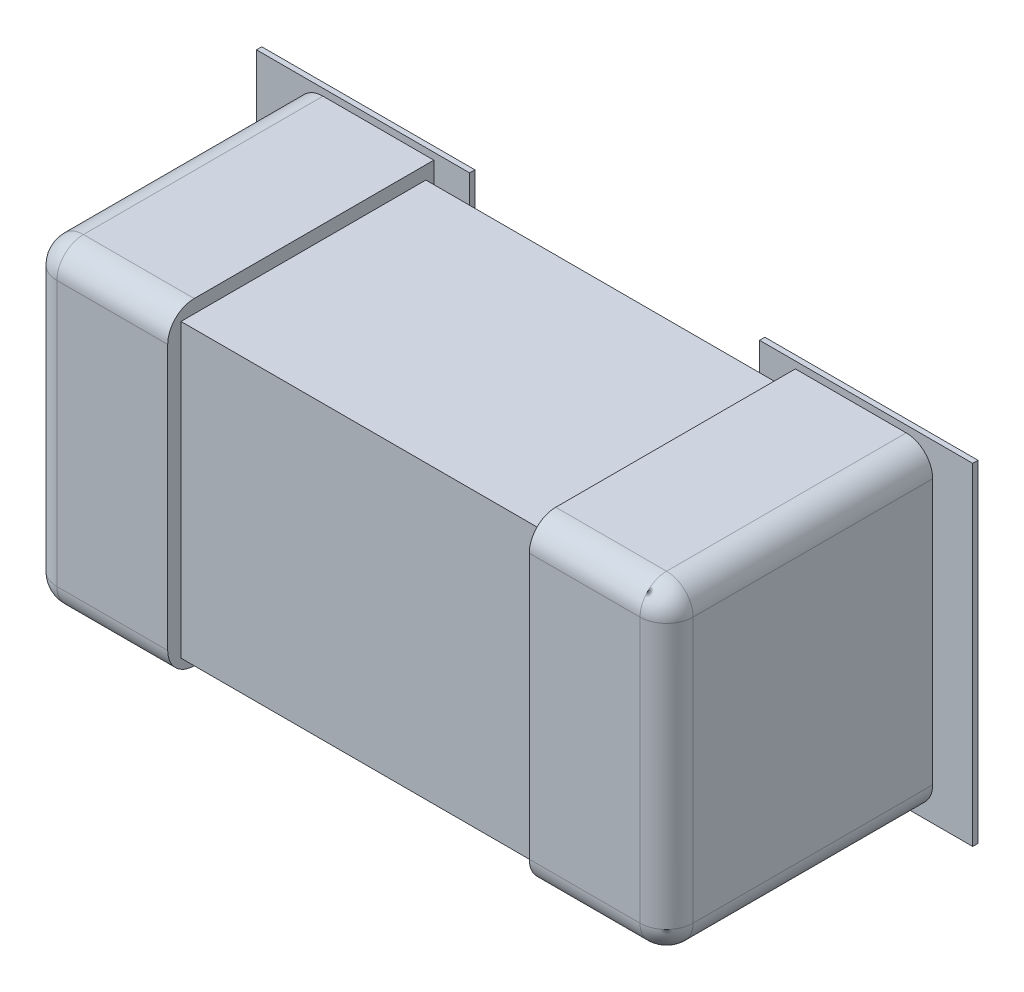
ISO-10303-21;
HEADER;
FILE_DESCRIPTION(('STEP AP214'),'2;1');
FILE_NAME('part.step','',(''),(''),'','','');
FILE_SCHEMA(('AUTOMOTIVE_DESIGN { 1 0 10303 214 1 1 1 1 }'));
ENDSEC;
DATA;
#1=APPLICATION_CONTEXT('core data for automotive mechanical design processes');
#2=APPLICATION_PROTOCOL_DEFINITION('international standard','automotive_design',2000,#1);
#3=PRODUCT_CONTEXT('',#1,'mechanical');
#4=PRODUCT('Part','Part','',(#3));
#5=PRODUCT_RELATED_PRODUCT_CATEGORY('part','',(#4));
#6=PRODUCT_DEFINITION_FORMATION('','',#4);
#7=PRODUCT_DEFINITION_CONTEXT('part definition',#1,'design');
#8=PRODUCT_DEFINITION('design','',#6,#7);
#9=PRODUCT_DEFINITION_SHAPE('','',#8);
#10=(LENGTH_UNIT() NAMED_UNIT(*) SI_UNIT(.MILLI.,.METRE.));
#11=(NAMED_UNIT(*) PLANE_ANGLE_UNIT() SI_UNIT($,.RADIAN.));
#12=(NAMED_UNIT(*) SI_UNIT($,.STERADIAN.) SOLID_ANGLE_UNIT());
#13=UNCERTAINTY_MEASURE_WITH_UNIT(LENGTH_MEASURE(1.E-05),#10,'distance_accuracy_value','');
#14=(GEOMETRIC_REPRESENTATION_CONTEXT(3) GLOBAL_UNCERTAINTY_ASSIGNED_CONTEXT((#13)) GLOBAL_UNIT_ASSIGNED_CONTEXT((#10,
#11,#12)) REPRESENTATION_CONTEXT('',''));
#15=CARTESIAN_POINT('',(0.,0.,0.));
#16=DIRECTION('',(0.,0.,1.));
#17=DIRECTION('',(1.,0.,0.));
#18=AXIS2_PLACEMENT_3D('',#15,#16,#17);
#19=CARTESIAN_POINT('',(0.,0.,0.0762));
#20=DIRECTION('',(0.,0.,1.));
#21=DIRECTION('',(1.,0.,0.));
#22=AXIS2_PLACEMENT_3D('',#19,#20,#21);
#23=PLANE('',#22);
#24=DIRECTION('',(1.,0.,0.));
#25=VECTOR('',#24,1.);
#26=CARTESIAN_POINT('',(0.138938,-0.159004,0.0762));
#27=LINE('',#26,#25);
#28=CARTESIAN_POINT('',(0.138938,-0.159004,0.0762));
#29=VERTEX_POINT('',#28);
#30=CARTESIAN_POINT('',(0.343154,-0.159004,0.0762));
#31=VERTEX_POINT('',#30);
#32=EDGE_CURVE('E330',#29,#31,#27,.T.);
#33=ORIENTED_EDGE('',*,*,#32,.F.);
#34=DIRECTION('',(0.,1.,0.));
#35=VECTOR('',#34,1.);
#36=CARTESIAN_POINT('',(0.138938,0.159004,0.0762));
#37=LINE('',#36,#35);
#38=CARTESIAN_POINT('',(0.138938,0.159004,0.0762));
#39=VERTEX_POINT('',#38);
#40=EDGE_CURVE('E335',#39,#29,#37,.F.);
#41=ORIENTED_EDGE('',*,*,#40,.F.);
#42=DIRECTION('',(1.,0.,0.));
#43=VECTOR('',#42,1.);
#44=CARTESIAN_POINT('',(0.343154,0.159004,0.0762));
#45=LINE('',#44,#43);
#46=CARTESIAN_POINT('',(0.343154,0.159004,0.0762));
#47=VERTEX_POINT('',#46);
#48=EDGE_CURVE('E319',#47,#39,#45,.F.);
#49=ORIENTED_EDGE('',*,*,#48,.F.);
#50=DIRECTION('',(0.,1.,0.));
#51=VECTOR('',#50,1.);
#52=CARTESIAN_POINT('',(0.343154,-0.159004,0.0762));
#53=LINE('',#52,#51);
#54=EDGE_CURVE('E95',#31,#47,#53,.T.);
#55=ORIENTED_EDGE('',*,*,#54,.F.);
#56=EDGE_LOOP('',(#33,#41,#49,#55));
#57=FACE_BOUND('',#56,.T.);
#58=ADVANCED_FACE('F16',(#57),#23,.F.);
#59=CARTESIAN_POINT('',(0.,0.,0.0762));
#60=DIRECTION('',(0.,0.,1.));
#61=DIRECTION('',(1.,0.,0.));
#62=AXIS2_PLACEMENT_3D('',#59,#60,#61);
#63=PLANE('',#62);
#64=DIRECTION('',(1.,0.,0.));
#65=VECTOR('',#64,1.);
#66=CARTESIAN_POINT('',(-0.138938,0.159004,0.0762));
#67=LINE('',#66,#65);
#68=CARTESIAN_POINT('',(-0.138938,0.159004,0.0762));
#69=VERTEX_POINT('',#68);
#70=CARTESIAN_POINT('',(-0.343154,0.159004,0.0762));
#71=VERTEX_POINT('',#70);
#72=EDGE_CURVE('E278',#69,#71,#67,.F.);
#73=ORIENTED_EDGE('',*,*,#72,.F.);
#74=DIRECTION('',(0.,1.,0.));
#75=VECTOR('',#74,1.);
#76=CARTESIAN_POINT('',(-0.138938,-0.159004,0.0762));
#77=LINE('',#76,#75);
#78=CARTESIAN_POINT('',(-0.138938,-0.159004,0.0762));
#79=VERTEX_POINT('',#78);
#80=EDGE_CURVE('E284',#79,#69,#77,.T.);
#81=ORIENTED_EDGE('',*,*,#80,.F.);
#82=DIRECTION('',(1.,0.,0.));
#83=VECTOR('',#82,1.);
#84=CARTESIAN_POINT('',(-0.343154,-0.159004,0.0762));
#85=LINE('',#84,#83);
#86=CARTESIAN_POINT('',(-0.343154,-0.159004,0.0762));
#87=VERTEX_POINT('',#86);
#88=EDGE_CURVE('E263',#87,#79,#85,.T.);
#89=ORIENTED_EDGE('',*,*,#88,.F.);
#90=DIRECTION('',(0.,1.,0.));
#91=VECTOR('',#90,1.);
#92=CARTESIAN_POINT('',(-0.343154,0.159004,0.0762));
#93=LINE('',#92,#91);
#94=EDGE_CURVE('E272',#71,#87,#93,.F.);
#95=ORIENTED_EDGE('',*,*,#94,.F.);
#96=EDGE_LOOP('',(#73,#81,#89,#95));
#97=FACE_BOUND('',#96,.T.);
#98=ADVANCED_FACE('F663',(#97),#63,.F.);
#99=CARTESIAN_POINT('',(0.138938,0.159004,0.0762));
#100=DIRECTION('',(-1.,0.,0.));
#101=DIRECTION('',(0.,0.,1.));
#102=AXIS2_PLACEMENT_3D('',#99,#100,#101);
#103=PLANE('',#102);
#104=DIRECTION('',(0.,0.,1.));
#105=VECTOR('',#104,1.);
#106=CARTESIAN_POINT('',(0.138938,0.159004,0.0762));
#107=LINE('',#106,#105);
#108=CARTESIAN_POINT('',(0.138938,0.159004,0.08128));
#109=VERTEX_POINT('',#108);
#110=EDGE_CURVE('E324',#39,#109,#107,.T.);
#111=ORIENTED_EDGE('',*,*,#110,.F.);
#112=ORIENTED_EDGE('',*,*,#40,.T.);
#113=DIRECTION('',(0.,0.,-1.));
#114=VECTOR('',#113,1.);
#115=CARTESIAN_POINT('',(0.138938,-0.159004,0.0762));
#116=LINE('',#115,#114);
#117=CARTESIAN_POINT('',(0.138938,-0.159004,0.08128));
#118=VERTEX_POINT('',#117);
#119=EDGE_CURVE('E332',#118,#29,#116,.T.);
#120=ORIENTED_EDGE('',*,*,#119,.F.);
#121=DIRECTION('',(0.,1.,0.));
#122=VECTOR('',#121,1.);
#123=CARTESIAN_POINT('',(0.138938,0.,0.08128));
#124=LINE('',#123,#122);
#125=EDGE_CURVE('E216',#109,#118,#124,.F.);
#126=ORIENTED_EDGE('',*,*,#125,.F.);
#127=EDGE_LOOP('',(#111,#112,#120,#126));
#128=FACE_BOUND('',#127,.T.);
#129=ADVANCED_FACE('F669',(#128),#103,.T.);
#130=CARTESIAN_POINT('',(0.138938,-0.159004,0.0762));
#131=DIRECTION('',(0.,-1.,0.));
#132=DIRECTION('',(0.,0.,-1.));
#133=AXIS2_PLACEMENT_3D('',#130,#131,#132);
#134=PLANE('',#133);
#135=ORIENTED_EDGE('',*,*,#119,.T.);
#136=ORIENTED_EDGE('',*,*,#32,.T.);
#137=DIRECTION('',(0.,0.,-1.));
#138=VECTOR('',#137,1.);
#139=CARTESIAN_POINT('',(0.343154,-0.159004,0.0762));
#140=LINE('',#139,#138);
#141=CARTESIAN_POINT('',(0.343154,-0.159004,0.08128));
#142=VERTEX_POINT('',#141);
#143=EDGE_CURVE('E328',#142,#31,#140,.T.);
#144=ORIENTED_EDGE('',*,*,#143,.F.);
#145=DIRECTION('',(1.,0.,0.));
#146=VECTOR('',#145,1.);
#147=CARTESIAN_POINT('',(0.,-0.159004,0.08128));
#148=LINE('',#147,#146);
#149=EDGE_CURVE('E213',#118,#142,#148,.T.);
#150=ORIENTED_EDGE('',*,*,#149,.F.);
#151=EDGE_LOOP('',(#135,#136,#144,#150));
#152=FACE_BOUND('',#151,.T.);
#153=ADVANCED_FACE('F714',(#152),#134,.T.);
#154=CARTESIAN_POINT('',(0.343154,-0.159004,0.0762));
#155=DIRECTION('',(1.,0.,0.));
#156=DIRECTION('',(0.,0.,-1.));
#157=AXIS2_PLACEMENT_3D('',#154,#155,#156);
#158=PLANE('',#157);
#159=ORIENTED_EDGE('',*,*,#143,.T.);
#160=ORIENTED_EDGE('',*,*,#54,.T.);
#161=DIRECTION('',(0.,0.,1.));
#162=VECTOR('',#161,1.);
#163=CARTESIAN_POINT('',(0.343154,0.159004,0.0762));
#164=LINE('',#163,#162);
#165=CARTESIAN_POINT('',(0.343154,0.159004,0.08128));
#166=VERTEX_POINT('',#165);
#167=EDGE_CURVE('E322',#166,#47,#164,.F.);
#168=ORIENTED_EDGE('',*,*,#167,.F.);
#169=DIRECTION('',(0.,1.,0.));
#170=VECTOR('',#169,1.);
#171=CARTESIAN_POINT('',(0.343154,0.,0.08128));
#172=LINE('',#171,#170);
#173=EDGE_CURVE('E210',#142,#166,#172,.T.);
#174=ORIENTED_EDGE('',*,*,#173,.F.);
#175=EDGE_LOOP('',(#159,#160,#168,#174));
#176=FACE_BOUND('',#175,.T.);
#177=ADVANCED_FACE('F721',(#176),#158,.T.);
#178=CARTESIAN_POINT('',(0.343154,0.159004,0.0762));
#179=DIRECTION('',(0.,1.,0.));
#180=DIRECTION('',(0.,0.,1.));
#181=AXIS2_PLACEMENT_3D('',#178,#179,#180);
#182=PLANE('',#181);
#183=ORIENTED_EDGE('',*,*,#167,.T.);
#184=ORIENTED_EDGE('',*,*,#48,.T.);
#185=ORIENTED_EDGE('',*,*,#110,.T.);
#186=DIRECTION('',(1.,0.,0.));
#187=VECTOR('',#186,1.);
#188=CARTESIAN_POINT('',(0.,0.159004,0.08128));
#189=LINE('',#188,#187);
#190=EDGE_CURVE('E207',#166,#109,#189,.F.);
#191=ORIENTED_EDGE('',*,*,#190,.F.);
#192=EDGE_LOOP('',(#183,#184,#185,#191));
#193=FACE_BOUND('',#192,.T.);
#194=ADVANCED_FACE('F729',(#193),#182,.T.);
#195=CARTESIAN_POINT('',(0.3048,-0.1524,0.0762));
#196=DIRECTION('',(1.,0.,0.));
#197=DIRECTION('',(0.,0.,-1.));
#198=AXIS2_PLACEMENT_3D('',#195,#196,#197);
#199=PLANE('',#198);
#200=DIRECTION('',(0.,0.,-1.));
#201=VECTOR('',#200,1.);
#202=CARTESIAN_POINT('',(0.3048,-0.127,0.6753571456));
#203=LINE('',#202,#201);
#204=CARTESIAN_POINT('',(0.3048,-0.127,0.08128));
#205=VERTEX_POINT('',#204);
#206=CARTESIAN_POINT('',(0.3048,-0.127,0.310896));
#207=VERTEX_POINT('',#206);
#208=EDGE_CURVE('E315',#205,#207,#203,.F.);
#209=ORIENTED_EDGE('',*,*,#208,.F.);
#210=DIRECTION('',(0.,1.,0.));
#211=VECTOR('',#210,1.);
#212=CARTESIAN_POINT('',(0.3048,0.,0.08128));
#213=LINE('',#212,#211);
#214=CARTESIAN_POINT('',(0.3048,0.127,0.08128));
#215=VERTEX_POINT('',#214);
#216=EDGE_CURVE('E205',#215,#205,#213,.F.);
#217=ORIENTED_EDGE('',*,*,#216,.F.);
#218=DIRECTION('',(0.,0.,-1.));
#219=VECTOR('',#218,1.);
#220=CARTESIAN_POINT('',(0.3048,0.127,0.6753571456));
#221=LINE('',#220,#219);
#222=CARTESIAN_POINT('',(0.3048,0.127,0.310896));
#223=VERTEX_POINT('',#222);
#224=EDGE_CURVE('E86',#223,#215,#221,.T.);
#225=ORIENTED_EDGE('',*,*,#224,.F.);
#226=DIRECTION('',(0.,1.,0.));
#227=VECTOR('',#226,1.);
#228=CARTESIAN_POINT('',(0.3048,-0.5735592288,0.310896));
#229=LINE('',#228,#227);
#230=EDGE_CURVE('E341',#207,#223,#229,.T.);
#231=ORIENTED_EDGE('',*,*,#230,.F.);
#232=EDGE_LOOP('',(#209,#217,#225,#231));
#233=FACE_BOUND('',#232,.T.);
#234=ADVANCED_FACE('F736',(#233),#199,.T.);
#235=CARTESIAN_POINT('',(0.2794,0.127,0.6753571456));
#236=DIRECTION('',(0.,0.,-1.));
#237=DIRECTION('',(-1.,0.,0.));
#238=AXIS2_PLACEMENT_3D('',#235,#236,#237);
#239=CYLINDRICAL_SURFACE('',#238,0.0254);
#240=ORIENTED_EDGE('',*,*,#224,.T.);
#241=CARTESIAN_POINT('',(0.2794,0.127,0.08128));
#242=DIRECTION('',(0.,0.,-1.));
#243=DIRECTION('',(-1.,0.,0.));
#244=AXIS2_PLACEMENT_3D('',#241,#242,#243);
#245=CIRCLE('',#244,0.0254);
#246=CARTESIAN_POINT('',(0.2794,0.1524,0.08128));
#247=VERTEX_POINT('',#246);
#248=EDGE_CURVE('E185',#247,#215,#245,.T.);
#249=ORIENTED_EDGE('',*,*,#248,.F.);
#250=DIRECTION('',(0.,0.,1.));
#251=VECTOR('',#250,1.);
#252=CARTESIAN_POINT('',(0.2794,0.1524,0.0762));
#253=LINE('',#252,#251);
#254=CARTESIAN_POINT('',(0.2794,0.1524,0.310896));
#255=VERTEX_POINT('',#254);
#256=EDGE_CURVE('E162',#255,#247,#253,.F.);
#257=ORIENTED_EDGE('',*,*,#256,.F.);
#258=CARTESIAN_POINT('',(0.2794,0.127,0.310896));
#259=DIRECTION('',(0.,0.,-1.));
#260=DIRECTION('',(-1.,0.,0.));
#261=AXIS2_PLACEMENT_3D('',#258,#259,#260);
#262=CIRCLE('',#261,0.0254);
#263=EDGE_CURVE('E19',#223,#255,#262,.F.);
#264=ORIENTED_EDGE('',*,*,#263,.F.);
#265=EDGE_LOOP('',(#240,#249,#257,#264));
#266=FACE_BOUND('',#265,.T.);
#267=ADVANCED_FACE('F183',(#266),#239,.T.);
#268=CARTESIAN_POINT('',(0.2794,0.127,0.310896));
#269=DIRECTION('',(0.,0.707106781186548,0.707106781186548));
#270=DIRECTION('',(1.,0.,0.));
#271=AXIS2_PLACEMENT_3D('',#268,#269,#270);
#272=SPHERICAL_SURFACE('',#271,0.0254);
#273=CARTESIAN_POINT('',(0.2794,0.127,0.310896));
#274=DIRECTION('',(-1.,0.,0.));
#275=DIRECTION('',(0.,0.,1.));
#276=AXIS2_PLACEMENT_3D('',#273,#274,#275);
#277=CIRCLE('',#276,0.0254);
#278=CARTESIAN_POINT('',(0.2794,0.127,0.336296));
#279=VERTEX_POINT('',#278);
#280=CARTESIAN_POINT('',(0.2794,0.144960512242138,0.328856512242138));
#281=VERTEX_POINT('',#280);
#282=EDGE_CURVE('E181',#279,#281,#277,.T.);
#283=ORIENTED_EDGE('',*,*,#282,.F.);
#284=CARTESIAN_POINT('',(0.2794,0.127,0.310896));
#285=DIRECTION('',(0.,1.,0.));
#286=DIRECTION('',(0.,0.,1.));
#287=AXIS2_PLACEMENT_3D('',#284,#285,#286);
#288=CIRCLE('',#287,0.0254);
#289=EDGE_CURVE('E172',#223,#279,#288,.F.);
#290=ORIENTED_EDGE('',*,*,#289,.F.);
#291=ORIENTED_EDGE('',*,*,#263,.T.);
#292=CARTESIAN_POINT('',(0.2794,0.127,0.310896));
#293=DIRECTION('',(-1.,0.,0.));
#294=DIRECTION('',(0.,0.,1.));
#295=AXIS2_PLACEMENT_3D('',#292,#293,#294);
#296=CIRCLE('',#295,0.0254);
#297=EDGE_CURVE('E171',#281,#255,#296,.T.);
#298=ORIENTED_EDGE('',*,*,#297,.F.);
#299=EDGE_LOOP('',(#283,#290,#291,#298));
#300=FACE_BOUND('',#299,.T.);
#301=ADVANCED_FACE('F170',(#300),#272,.T.);
#302=CARTESIAN_POINT('',(0.2794,-0.5735592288,0.310896));
#303=DIRECTION('',(0.,1.,0.));
#304=DIRECTION('',(0.,0.,1.));
#305=AXIS2_PLACEMENT_3D('',#302,#303,#304);
#306=CYLINDRICAL_SURFACE('',#305,0.0254);
#307=CARTESIAN_POINT('',(0.2794,-0.127,0.310896));
#308=DIRECTION('',(0.,1.,0.));
#309=DIRECTION('',(0.,0.,1.));
#310=AXIS2_PLACEMENT_3D('',#307,#308,#309);
#311=CIRCLE('',#310,0.0254);
#312=CARTESIAN_POINT('',(0.297360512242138,-0.127,0.328856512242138));
#313=VERTEX_POINT('',#312);
#314=EDGE_CURVE('E343',#207,#313,#311,.F.);
#315=ORIENTED_EDGE('',*,*,#314,.F.);
#316=ORIENTED_EDGE('',*,*,#230,.T.);
#317=ORIENTED_EDGE('',*,*,#289,.T.);
#318=DIRECTION('',(0.,1.,0.));
#319=VECTOR('',#318,1.);
#320=CARTESIAN_POINT('',(0.2794,0.,0.336296));
#321=LINE('',#320,#319);
#322=CARTESIAN_POINT('',(0.2794,-0.127,0.336296));
#323=VERTEX_POINT('',#322);
#324=EDGE_CURVE('E194',#323,#279,#321,.T.);
#325=ORIENTED_EDGE('',*,*,#324,.F.);
#326=CARTESIAN_POINT('',(0.2794,-0.127,0.310896));
#327=DIRECTION('',(0.,-1.,0.));
#328=DIRECTION('',(0.707106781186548,0.,0.707106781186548));
#329=AXIS2_PLACEMENT_3D('',#326,#327,#328);
#330=CIRCLE('',#329,0.0254);
#331=EDGE_CURVE('E295',#313,#323,#330,.T.);
#332=ORIENTED_EDGE('',*,*,#331,.F.);
#333=EDGE_LOOP('',(#315,#316,#317,#325,#332));
#334=FACE_BOUND('',#333,.T.);
#335=ADVANCED_FACE('F303',(#334),#306,.T.);
#336=CARTESIAN_POINT('',(0.2794,-0.127,0.310896));
#337=DIRECTION('',(0.707106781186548,0.,0.707106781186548));
#338=DIRECTION('',(0.,-1.,0.));
#339=AXIS2_PLACEMENT_3D('',#336,#337,#338);
#340=SPHERICAL_SURFACE('',#339,0.0254);
#341=ORIENTED_EDGE('',*,*,#331,.T.);
#342=CARTESIAN_POINT('',(0.2794,-0.127,0.310896));
#343=DIRECTION('',(1.,0.,0.));
#344=DIRECTION('',(0.,0.,-1.));
#345=AXIS2_PLACEMENT_3D('',#342,#343,#344);
#346=CIRCLE('',#345,0.0254);
#347=CARTESIAN_POINT('',(0.2794,-0.1524,0.310896));
#348=VERTEX_POINT('',#347);
#349=EDGE_CURVE('E373',#348,#323,#346,.F.);
#350=ORIENTED_EDGE('',*,*,#349,.F.);
#351=CARTESIAN_POINT('',(0.2794,-0.127,0.310896));
#352=DIRECTION('',(0.,0.,-1.));
#353=DIRECTION('',(-1.,0.,0.));
#354=AXIS2_PLACEMENT_3D('',#351,#352,#353);
#355=CIRCLE('',#354,0.0254);
#356=EDGE_CURVE('E287',#207,#348,#355,.T.);
#357=ORIENTED_EDGE('',*,*,#356,.F.);
#358=ORIENTED_EDGE('',*,*,#314,.T.);
#359=EDGE_LOOP('',(#341,#350,#357,#358));
#360=FACE_BOUND('',#359,.T.);
#361=ADVANCED_FACE('F298',(#360),#340,.T.);
#362=CARTESIAN_POINT('',(0.2794,-0.127,0.6753571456));
#363=DIRECTION('',(0.,0.,-1.));
#364=DIRECTION('',(-1.,0.,0.));
#365=AXIS2_PLACEMENT_3D('',#362,#363,#364);
#366=CYLINDRICAL_SURFACE('',#365,0.0254);
#367=DIRECTION('',(0.,0.,-1.));
#368=VECTOR('',#367,1.);
#369=CARTESIAN_POINT('',(0.2794,-0.1524,0.0762));
#370=LINE('',#369,#368);
#371=CARTESIAN_POINT('',(0.2794,-0.1524,0.08128));
#372=VERTEX_POINT('',#371);
#373=EDGE_CURVE('E288',#372,#348,#370,.F.);
#374=ORIENTED_EDGE('',*,*,#373,.F.);
#375=CARTESIAN_POINT('',(0.2794,-0.127,0.08128));
#376=DIRECTION('',(0.,0.,-1.));
#377=DIRECTION('',(-1.,0.,0.));
#378=AXIS2_PLACEMENT_3D('',#375,#376,#377);
#379=CIRCLE('',#378,0.0254);
#380=EDGE_CURVE('E188',#205,#372,#379,.T.);
#381=ORIENTED_EDGE('',*,*,#380,.F.);
#382=ORIENTED_EDGE('',*,*,#208,.T.);
#383=ORIENTED_EDGE('',*,*,#356,.T.);
#384=EDGE_LOOP('',(#374,#381,#382,#383));
#385=FACE_BOUND('',#384,.T.);
#386=ADVANCED_FACE('F302',(#385),#366,.T.);
#387=CARTESIAN_POINT('',(-0.138938,-0.159004,0.0762));
#388=DIRECTION('',(1.,0.,0.));
#389=DIRECTION('',(0.,0.,-1.));
#390=AXIS2_PLACEMENT_3D('',#387,#388,#389);
#391=PLANE('',#390);
#392=DIRECTION('',(0.,0.,-1.));
#393=VECTOR('',#392,1.);
#394=CARTESIAN_POINT('',(-0.138938,-0.159004,0.0762));
#395=LINE('',#394,#393);
#396=CARTESIAN_POINT('',(-0.138938,-0.159004,0.08128));
#397=VERTEX_POINT('',#396);
#398=EDGE_CURVE('E269',#79,#397,#395,.F.);
#399=ORIENTED_EDGE('',*,*,#398,.F.);
#400=ORIENTED_EDGE('',*,*,#80,.T.);
#401=DIRECTION('',(0.,0.,1.));
#402=VECTOR('',#401,1.);
#403=CARTESIAN_POINT('',(-0.138938,0.159004,0.0762));
#404=LINE('',#403,#402);
#405=CARTESIAN_POINT('',(-0.138938,0.159004,0.08128));
#406=VERTEX_POINT('',#405);
#407=EDGE_CURVE('E281',#406,#69,#404,.F.);
#408=ORIENTED_EDGE('',*,*,#407,.F.);
#409=DIRECTION('',(0.,1.,0.));
#410=VECTOR('',#409,1.);
#411=CARTESIAN_POINT('',(-0.138938,0.,0.08128));
#412=LINE('',#411,#410);
#413=EDGE_CURVE('E438',#397,#406,#412,.T.);
#414=ORIENTED_EDGE('',*,*,#413,.F.);
#415=EDGE_LOOP('',(#399,#400,#408,#414));
#416=FACE_BOUND('',#415,.T.);
#417=ADVANCED_FACE('F766',(#416),#391,.T.);
#418=CARTESIAN_POINT('',(-0.138938,0.159004,0.0762));
#419=DIRECTION('',(0.,1.,0.));
#420=DIRECTION('',(0.,0.,1.));
#421=AXIS2_PLACEMENT_3D('',#418,#419,#420);
#422=PLANE('',#421);
#423=ORIENTED_EDGE('',*,*,#407,.T.);
#424=ORIENTED_EDGE('',*,*,#72,.T.);
#425=DIRECTION('',(0.,0.,1.));
#426=VECTOR('',#425,1.);
#427=CARTESIAN_POINT('',(-0.343154,0.159004,0.0762));
#428=LINE('',#427,#426);
#429=CARTESIAN_POINT('',(-0.343154,0.159004,0.08128));
#430=VERTEX_POINT('',#429);
#431=EDGE_CURVE('E275',#430,#71,#428,.F.);
#432=ORIENTED_EDGE('',*,*,#431,.F.);
#433=DIRECTION('',(1.,0.,0.));
#434=VECTOR('',#433,1.);
#435=CARTESIAN_POINT('',(0.,0.159004,0.08128));
#436=LINE('',#435,#434);
#437=EDGE_CURVE('E435',#406,#430,#436,.F.);
#438=ORIENTED_EDGE('',*,*,#437,.F.);
#439=EDGE_LOOP('',(#423,#424,#432,#438));
#440=FACE_BOUND('',#439,.T.);
#441=ADVANCED_FACE('F772',(#440),#422,.T.);
#442=CARTESIAN_POINT('',(-0.343154,0.159004,0.0762));
#443=DIRECTION('',(-1.,0.,0.));
#444=DIRECTION('',(0.,0.,1.));
#445=AXIS2_PLACEMENT_3D('',#442,#443,#444);
#446=PLANE('',#445);
#447=ORIENTED_EDGE('',*,*,#431,.T.);
#448=ORIENTED_EDGE('',*,*,#94,.T.);
#449=DIRECTION('',(0.,0.,-1.));
#450=VECTOR('',#449,1.);
#451=CARTESIAN_POINT('',(-0.343154,-0.159004,0.0762));
#452=LINE('',#451,#450);
#453=CARTESIAN_POINT('',(-0.343154,-0.159004,0.08128));
#454=VERTEX_POINT('',#453);
#455=EDGE_CURVE('E266',#454,#87,#452,.T.);
#456=ORIENTED_EDGE('',*,*,#455,.F.);
#457=DIRECTION('',(0.,1.,0.));
#458=VECTOR('',#457,1.);
#459=CARTESIAN_POINT('',(-0.343154,0.,0.08128));
#460=LINE('',#459,#458);
#461=EDGE_CURVE('E432',#430,#454,#460,.F.);
#462=ORIENTED_EDGE('',*,*,#461,.F.);
#463=EDGE_LOOP('',(#447,#448,#456,#462));
#464=FACE_BOUND('',#463,.T.);
#465=ADVANCED_FACE('F779',(#464),#446,.T.);
#466=CARTESIAN_POINT('',(-0.343154,-0.159004,0.0762));
#467=DIRECTION('',(0.,-1.,0.));
#468=DIRECTION('',(0.,0.,-1.));
#469=AXIS2_PLACEMENT_3D('',#466,#467,#468);
#470=PLANE('',#469);
#471=ORIENTED_EDGE('',*,*,#455,.T.);
#472=ORIENTED_EDGE('',*,*,#88,.T.);
#473=ORIENTED_EDGE('',*,*,#398,.T.);
#474=DIRECTION('',(1.,0.,0.));
#475=VECTOR('',#474,1.);
#476=CARTESIAN_POINT('',(0.,-0.159004,0.08128));
#477=LINE('',#476,#475);
#478=EDGE_CURVE('E372',#454,#397,#477,.T.);
#479=ORIENTED_EDGE('',*,*,#478,.F.);
#480=EDGE_LOOP('',(#471,#472,#473,#479));
#481=FACE_BOUND('',#480,.T.);
#482=ADVANCED_FACE('F787',(#481),#470,.T.);
#483=CARTESIAN_POINT('',(-0.3048,0.1524,0.0762));
#484=DIRECTION('',(-1.,0.,0.));
#485=DIRECTION('',(0.,0.,1.));
#486=AXIS2_PLACEMENT_3D('',#483,#484,#485);
#487=PLANE('',#486);
#488=DIRECTION('',(0.,0.,-1.));
#489=VECTOR('',#488,1.);
#490=CARTESIAN_POINT('',(-0.3048,0.127,0.6753571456));
#491=LINE('',#490,#489);
#492=CARTESIAN_POINT('',(-0.3048,0.127,0.08128));
#493=VERTEX_POINT('',#492);
#494=CARTESIAN_POINT('',(-0.3048,0.127,0.310896));
#495=VERTEX_POINT('',#494);
#496=EDGE_CURVE('E226',#493,#495,#491,.F.);
#497=ORIENTED_EDGE('',*,*,#496,.F.);
#498=DIRECTION('',(0.,1.,0.));
#499=VECTOR('',#498,1.);
#500=CARTESIAN_POINT('',(-0.3048,0.,0.08128));
#501=LINE('',#500,#499);
#502=CARTESIAN_POINT('',(-0.3048,-0.127,0.08128));
#503=VERTEX_POINT('',#502);
#504=EDGE_CURVE('E368',#503,#493,#501,.T.);
#505=ORIENTED_EDGE('',*,*,#504,.F.);
#506=DIRECTION('',(0.,0.,-1.));
#507=VECTOR('',#506,1.);
#508=CARTESIAN_POINT('',(-0.3048,-0.127,0.6753571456));
#509=LINE('',#508,#507);
#510=CARTESIAN_POINT('',(-0.3048,-0.127,0.310896));
#511=VERTEX_POINT('',#510);
#512=EDGE_CURVE('E260',#511,#503,#509,.T.);
#513=ORIENTED_EDGE('',*,*,#512,.F.);
#514=DIRECTION('',(0.,-1.,0.));
#515=VECTOR('',#514,1.);
#516=CARTESIAN_POINT('',(-0.3048,0.5735592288,0.310896));
#517=LINE('',#516,#515);
#518=EDGE_CURVE('E337',#495,#511,#517,.T.);
#519=ORIENTED_EDGE('',*,*,#518,.F.);
#520=EDGE_LOOP('',(#497,#505,#513,#519));
#521=FACE_BOUND('',#520,.T.);
#522=ADVANCED_FACE('F795',(#521),#487,.T.);
#523=CARTESIAN_POINT('',(-0.2794,-0.127,0.6753571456));
#524=DIRECTION('',(0.,0.,-1.));
#525=DIRECTION('',(-1.,0.,0.));
#526=AXIS2_PLACEMENT_3D('',#523,#524,#525);
#527=CYLINDRICAL_SURFACE('',#526,0.0254);
#528=ORIENTED_EDGE('',*,*,#512,.T.);
#529=CARTESIAN_POINT('',(-0.2794,-0.127,0.08128));
#530=DIRECTION('',(0.,0.,-1.));
#531=DIRECTION('',(-1.,0.,0.));
#532=AXIS2_PLACEMENT_3D('',#529,#530,#531);
#533=CIRCLE('',#532,0.0254);
#534=CARTESIAN_POINT('',(-0.2794,-0.1524,0.08128));
#535=VERTEX_POINT('',#534);
#536=EDGE_CURVE('E369',#535,#503,#533,.T.);
#537=ORIENTED_EDGE('',*,*,#536,.F.);
#538=DIRECTION('',(0.,0.,-1.));
#539=VECTOR('',#538,1.);
#540=CARTESIAN_POINT('',(-0.2794,-0.1524,0.0762));
#541=LINE('',#540,#539);
#542=CARTESIAN_POINT('',(-0.2794,-0.1524,0.310896));
#543=VERTEX_POINT('',#542);
#544=EDGE_CURVE('E257',#543,#535,#541,.T.);
#545=ORIENTED_EDGE('',*,*,#544,.F.);
#546=CARTESIAN_POINT('',(-0.2794,-0.127,0.310896));
#547=DIRECTION('',(0.,0.,-1.));
#548=DIRECTION('',(-1.,0.,0.));
#549=AXIS2_PLACEMENT_3D('',#546,#547,#548);
#550=CIRCLE('',#549,0.0254);
#551=EDGE_CURVE('E262',#511,#543,#550,.F.);
#552=ORIENTED_EDGE('',*,*,#551,.F.);
#553=EDGE_LOOP('',(#528,#537,#545,#552));
#554=FACE_BOUND('',#553,.T.);
#555=ADVANCED_FACE('F252',(#554),#527,.T.);
#556=CARTESIAN_POINT('',(-0.2794,-0.127,0.310896));
#557=DIRECTION('',(0.,-0.707106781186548,0.707106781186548));
#558=DIRECTION('',(-1.,0.,0.));
#559=AXIS2_PLACEMENT_3D('',#556,#557,#558);
#560=SPHERICAL_SURFACE('',#559,0.0254);
#561=CARTESIAN_POINT('',(-0.2794,-0.127,0.310896));
#562=DIRECTION('',(1.,0.,0.));
#563=DIRECTION('',(0.,0.,-1.));
#564=AXIS2_PLACEMENT_3D('',#561,#562,#563);
#565=CIRCLE('',#564,0.0254);
#566=CARTESIAN_POINT('',(-0.2794,-0.127,0.336296));
#567=VERTEX_POINT('',#566);
#568=CARTESIAN_POINT('',(-0.2794,-0.144960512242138,0.328856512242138));
#569=VERTEX_POINT('',#568);
#570=EDGE_CURVE('E234',#567,#569,#565,.T.);
#571=ORIENTED_EDGE('',*,*,#570,.F.);
#572=CARTESIAN_POINT('',(-0.2794,-0.127,0.310896));
#573=DIRECTION('',(0.,-1.,0.));
#574=DIRECTION('',(0.,0.,-1.));
#575=AXIS2_PLACEMENT_3D('',#572,#573,#574);
#576=CIRCLE('',#575,0.0254);
#577=EDGE_CURVE('E340',#511,#567,#576,.F.);
#578=ORIENTED_EDGE('',*,*,#577,.F.);
#579=ORIENTED_EDGE('',*,*,#551,.T.);
#580=CARTESIAN_POINT('',(-0.2794,-0.127,0.310896));
#581=DIRECTION('',(1.,0.,0.));
#582=DIRECTION('',(0.,0.,-1.));
#583=AXIS2_PLACEMENT_3D('',#580,#581,#582);
#584=CIRCLE('',#583,0.0254);
#585=EDGE_CURVE('E363',#569,#543,#584,.T.);
#586=ORIENTED_EDGE('',*,*,#585,.F.);
#587=EDGE_LOOP('',(#571,#578,#579,#586));
#588=FACE_BOUND('',#587,.T.);
#589=ADVANCED_FACE('F247',(#588),#560,.T.);
#590=CARTESIAN_POINT('',(-0.2794,0.5735592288,0.310896));
#591=DIRECTION('',(0.,-1.,0.));
#592=DIRECTION('',(0.,0.,-1.));
#593=AXIS2_PLACEMENT_3D('',#590,#591,#592);
#594=CYLINDRICAL_SURFACE('',#593,0.0254);
#595=CARTESIAN_POINT('',(-0.2794,0.127,0.310896));
#596=DIRECTION('',(0.,-1.,0.));
#597=DIRECTION('',(0.,0.,-1.));
#598=AXIS2_PLACEMENT_3D('',#595,#596,#597);
#599=CIRCLE('',#598,0.0254);
#600=CARTESIAN_POINT('',(-0.2794,0.127,0.336296));
#601=VERTEX_POINT('',#600);
#602=EDGE_CURVE('E259',#495,#601,#599,.F.);
#603=ORIENTED_EDGE('',*,*,#602,.F.);
#604=ORIENTED_EDGE('',*,*,#518,.T.);
#605=ORIENTED_EDGE('',*,*,#577,.T.);
#606=DIRECTION('',(0.,1.,0.));
#607=VECTOR('',#606,1.);
#608=CARTESIAN_POINT('',(-0.2794,0.,0.336296));
#609=LINE('',#608,#607);
#610=EDGE_CURVE('E227',#601,#567,#609,.F.);
#611=ORIENTED_EDGE('',*,*,#610,.F.);
#612=EDGE_LOOP('',(#603,#604,#605,#611));
#613=FACE_BOUND('',#612,.T.);
#614=ADVANCED_FACE('F242',(#613),#594,.T.);
#615=CARTESIAN_POINT('',(-0.2794,0.127,0.310896));
#616=DIRECTION('',(-0.707106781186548,0.707106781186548,0.));
#617=DIRECTION('',(0.,0.,1.));
#618=AXIS2_PLACEMENT_3D('',#615,#616,#617);
#619=SPHERICAL_SURFACE('',#618,0.0254);
#620=ORIENTED_EDGE('',*,*,#602,.T.);
#621=CARTESIAN_POINT('',(-0.2794,0.127,0.310896));
#622=DIRECTION('',(-1.,0.,0.));
#623=DIRECTION('',(0.,0.,1.));
#624=AXIS2_PLACEMENT_3D('',#621,#622,#623);
#625=CIRCLE('',#624,0.0254);
#626=CARTESIAN_POINT('',(-0.2794,0.1524,0.310896));
#627=VERTEX_POINT('',#626);
#628=EDGE_CURVE('E360',#627,#601,#625,.F.);
#629=ORIENTED_EDGE('',*,*,#628,.F.);
#630=CARTESIAN_POINT('',(-0.2794,0.127,0.310896));
#631=DIRECTION('',(0.,0.,-1.));
#632=DIRECTION('',(-1.,0.,0.));
#633=AXIS2_PLACEMENT_3D('',#630,#631,#632);
#634=CIRCLE('',#633,0.0254);
#635=CARTESIAN_POINT('',(-0.297360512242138,0.144960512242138,0.310896));
#636=VERTEX_POINT('',#635);
#637=EDGE_CURVE('E219',#636,#627,#634,.T.);
#638=ORIENTED_EDGE('',*,*,#637,.F.);
#639=CARTESIAN_POINT('',(-0.2794,0.127,0.310896));
#640=DIRECTION('',(0.,0.,-1.));
#641=DIRECTION('',(-1.,0.,0.));
#642=AXIS2_PLACEMENT_3D('',#639,#640,#641);
#643=CIRCLE('',#642,0.0254);
#644=EDGE_CURVE('E34',#495,#636,#643,.T.);
#645=ORIENTED_EDGE('',*,*,#644,.F.);
#646=EDGE_LOOP('',(#620,#629,#638,#645));
#647=FACE_BOUND('',#646,.T.);
#648=ADVANCED_FACE('F237',(#647),#619,.T.);
#649=CARTESIAN_POINT('',(-0.2794,0.127,0.6753571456));
#650=DIRECTION('',(0.,0.,-1.));
#651=DIRECTION('',(-1.,0.,0.));
#652=AXIS2_PLACEMENT_3D('',#649,#650,#651);
#653=CYLINDRICAL_SURFACE('',#652,0.0254);
#654=DIRECTION('',(0.,0.,1.));
#655=VECTOR('',#654,1.);
#656=CARTESIAN_POINT('',(-0.2794,0.1524,0.0762));
#657=LINE('',#656,#655);
#658=CARTESIAN_POINT('',(-0.2794,0.1524,0.08128));
#659=VERTEX_POINT('',#658);
#660=EDGE_CURVE('E220',#659,#627,#657,.T.);
#661=ORIENTED_EDGE('',*,*,#660,.F.);
#662=CARTESIAN_POINT('',(-0.2794,0.127,0.08128));
#663=DIRECTION('',(0.,0.,-1.));
#664=DIRECTION('',(-1.,0.,0.));
#665=AXIS2_PLACEMENT_3D('',#662,#663,#664);
#666=CIRCLE('',#665,0.0254);
#667=EDGE_CURVE('E366',#493,#659,#666,.T.);
#668=ORIENTED_EDGE('',*,*,#667,.F.);
#669=ORIENTED_EDGE('',*,*,#496,.T.);
#670=ORIENTED_EDGE('',*,*,#644,.T.);
#671=ORIENTED_EDGE('',*,*,#637,.T.);
#672=EDGE_LOOP('',(#661,#668,#669,#670,#671));
#673=FACE_BOUND('',#672,.T.);
#674=ADVANCED_FACE('F241',(#673),#653,.T.);
#675=CARTESIAN_POINT('',(0.,0.,0.08128));
#676=DIRECTION('',(0.,0.,1.));
#677=DIRECTION('',(1.,0.,0.));
#678=AXIS2_PLACEMENT_3D('',#675,#676,#677);
#679=PLANE('',#678);
#680=DIRECTION('',(0.,1.,0.));
#681=VECTOR('',#680,1.);
#682=CARTESIAN_POINT('',(0.173228,-0.1524,0.08128));
#683=LINE('',#682,#681);
#684=CARTESIAN_POINT('',(0.173228,-0.1524,0.08128));
#685=VERTEX_POINT('',#684);
#686=CARTESIAN_POINT('',(0.173228,0.1524,0.08128));
#687=VERTEX_POINT('',#686);
#688=EDGE_CURVE('E403',#685,#687,#683,.T.);
#689=ORIENTED_EDGE('',*,*,#688,.T.);
#690=DIRECTION('',(1.,0.,0.));
#691=VECTOR('',#690,1.);
#692=CARTESIAN_POINT('',(0.3048,0.1524,0.08128));
#693=LINE('',#692,#691);
#694=EDGE_CURVE('E187',#247,#687,#693,.F.);
#695=ORIENTED_EDGE('',*,*,#694,.F.);
#696=ORIENTED_EDGE('',*,*,#248,.T.);
#697=ORIENTED_EDGE('',*,*,#216,.T.);
#698=ORIENTED_EDGE('',*,*,#380,.T.);
#699=DIRECTION('',(1.,0.,0.));
#700=VECTOR('',#699,1.);
#701=CARTESIAN_POINT('',(-0.3048,-0.1524,0.08128));
#702=LINE('',#701,#700);
#703=EDGE_CURVE('E441',#685,#372,#702,.T.);
#704=ORIENTED_EDGE('',*,*,#703,.F.);
#705=EDGE_LOOP('',(#689,#695,#696,#697,#698,#704));
#706=FACE_BOUND('',#705,.T.);
#707=ORIENTED_EDGE('',*,*,#173,.T.);
#708=ORIENTED_EDGE('',*,*,#190,.T.);
#709=ORIENTED_EDGE('',*,*,#125,.T.);
#710=ORIENTED_EDGE('',*,*,#149,.T.);
#711=EDGE_LOOP('',(#707,#708,#709,#710));
#712=FACE_BOUND('',#711,.T.);
#713=ADVANCED_FACE('F463',(#706,#712),#679,.T.);
#714=CARTESIAN_POINT('',(0.3048,0.1524,0.0762));
#715=DIRECTION('',(0.,1.,0.));
#716=DIRECTION('',(0.,0.,1.));
#717=AXIS2_PLACEMENT_3D('',#714,#715,#716);
#718=PLANE('',#717);
#719=ORIENTED_EDGE('',*,*,#256,.T.);
#720=ORIENTED_EDGE('',*,*,#694,.T.);
#721=DIRECTION('',(0.,0.,-1.));
#722=VECTOR('',#721,1.);
#723=CARTESIAN_POINT('',(0.173228,0.1524,0.0889));
#724=LINE('',#723,#722);
#725=CARTESIAN_POINT('',(0.173228,0.1524,0.310896));
#726=VERTEX_POINT('',#725);
#727=EDGE_CURVE('E193',#687,#726,#724,.F.);
#728=ORIENTED_EDGE('',*,*,#727,.T.);
#729=DIRECTION('',(-1.,0.,0.));
#730=VECTOR('',#729,1.);
#731=CARTESIAN_POINT('',(1.2378251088,0.1524,0.310896));
#732=LINE('',#731,#730);
#733=EDGE_CURVE('E178',#255,#726,#732,.T.);
#734=ORIENTED_EDGE('',*,*,#733,.F.);
#735=EDGE_LOOP('',(#719,#720,#728,#734));
#736=FACE_BOUND('',#735,.T.);
#737=ADVANCED_FACE('F191',(#736),#718,.T.);
#738=CARTESIAN_POINT('',(1.2378251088,0.127,0.310896));
#739=DIRECTION('',(-1.,0.,0.));
#740=DIRECTION('',(0.,0.,1.));
#741=AXIS2_PLACEMENT_3D('',#738,#739,#740);
#742=CYLINDRICAL_SURFACE('',#741,0.0254);
#743=ORIENTED_EDGE('',*,*,#733,.T.);
#744=CARTESIAN_POINT('',(0.173228,0.127,0.310896));
#745=DIRECTION('',(-1.,0.,0.));
#746=DIRECTION('',(0.,0.,1.));
#747=AXIS2_PLACEMENT_3D('',#744,#745,#746);
#748=CIRCLE('',#747,0.0254);
#749=CARTESIAN_POINT('',(0.173228,0.127,0.336296));
#750=VERTEX_POINT('',#749);
#751=EDGE_CURVE('E358',#726,#750,#748,.F.);
#752=ORIENTED_EDGE('',*,*,#751,.T.);
#753=DIRECTION('',(1.,0.,0.));
#754=VECTOR('',#753,1.);
#755=CARTESIAN_POINT('',(0.,0.127,0.336296));
#756=LINE('',#755,#754);
#757=EDGE_CURVE('E197',#279,#750,#756,.F.);
#758=ORIENTED_EDGE('',*,*,#757,.F.);
#759=ORIENTED_EDGE('',*,*,#282,.T.);
#760=ORIENTED_EDGE('',*,*,#297,.T.);
#761=EDGE_LOOP('',(#743,#752,#758,#759,#760));
#762=FACE_BOUND('',#761,.T.);
#763=ADVANCED_FACE('F176',(#762),#742,.T.);
#764=CARTESIAN_POINT('',(0.,0.,0.336296));
#765=DIRECTION('',(0.,0.,1.));
#766=DIRECTION('',(1.,0.,0.));
#767=AXIS2_PLACEMENT_3D('',#764,#765,#766);
#768=PLANE('',#767);
#769=ORIENTED_EDGE('',*,*,#324,.T.);
#770=ORIENTED_EDGE('',*,*,#757,.T.);
#771=DIRECTION('',(0.,1.,0.));
#772=VECTOR('',#771,1.);
#773=CARTESIAN_POINT('',(0.173228,-0.1524,0.336296));
#774=LINE('',#773,#772);
#775=CARTESIAN_POINT('',(0.173228,-0.127,0.336296));
#776=VERTEX_POINT('',#775);
#777=EDGE_CURVE('E357',#750,#776,#774,.F.);
#778=ORIENTED_EDGE('',*,*,#777,.T.);
#779=DIRECTION('',(1.,0.,0.));
#780=VECTOR('',#779,1.);
#781=CARTESIAN_POINT('',(-1.2378251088,-0.127,0.336296));
#782=LINE('',#781,#780);
#783=EDGE_CURVE('E291',#323,#776,#782,.F.);
#784=ORIENTED_EDGE('',*,*,#783,.F.);
#785=EDGE_LOOP('',(#769,#770,#778,#784));
#786=FACE_BOUND('',#785,.T.);
#787=ADVANCED_FACE('F388',(#786),#768,.T.);
#788=CARTESIAN_POINT('',(-1.2378251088,-0.127,0.310896));
#789=DIRECTION('',(1.,0.,0.));
#790=DIRECTION('',(0.,0.,-1.));
#791=AXIS2_PLACEMENT_3D('',#788,#789,#790);
#792=CYLINDRICAL_SURFACE('',#791,0.0254);
#793=ORIENTED_EDGE('',*,*,#783,.T.);
#794=CARTESIAN_POINT('',(0.173228,-0.127,0.310896));
#795=DIRECTION('',(1.,0.,0.));
#796=DIRECTION('',(0.,0.,-1.));
#797=AXIS2_PLACEMENT_3D('',#794,#795,#796);
#798=CIRCLE('',#797,0.0254);
#799=CARTESIAN_POINT('',(0.173228,-0.1524,0.310896));
#800=VERTEX_POINT('',#799);
#801=EDGE_CURVE('E353',#776,#800,#798,.T.);
#802=ORIENTED_EDGE('',*,*,#801,.T.);
#803=DIRECTION('',(1.,0.,0.));
#804=VECTOR('',#803,1.);
#805=CARTESIAN_POINT('',(-0.3048,-0.1524,0.310896));
#806=LINE('',#805,#804);
#807=EDGE_CURVE('E290',#348,#800,#806,.F.);
#808=ORIENTED_EDGE('',*,*,#807,.F.);
#809=ORIENTED_EDGE('',*,*,#349,.T.);
#810=EDGE_LOOP('',(#793,#802,#808,#809));
#811=FACE_BOUND('',#810,.T.);
#812=ADVANCED_FACE('F450',(#811),#792,.T.);
#813=CARTESIAN_POINT('',(-0.3048,-0.1524,0.0762));
#814=DIRECTION('',(0.,-1.,0.));
#815=DIRECTION('',(0.,0.,-1.));
#816=AXIS2_PLACEMENT_3D('',#813,#814,#815);
#817=PLANE('',#816);
#818=DIRECTION('',(0.,0.,-1.));
#819=VECTOR('',#818,1.);
#820=CARTESIAN_POINT('',(0.173228,-0.1524,0.0889));
#821=LINE('',#820,#819);
#822=EDGE_CURVE('E356',#800,#685,#821,.T.);
#823=ORIENTED_EDGE('',*,*,#822,.T.);
#824=ORIENTED_EDGE('',*,*,#703,.T.);
#825=ORIENTED_EDGE('',*,*,#373,.T.);
#826=ORIENTED_EDGE('',*,*,#807,.T.);
#827=EDGE_LOOP('',(#823,#824,#825,#826));
#828=FACE_BOUND('',#827,.T.);
#829=ADVANCED_FACE('F460',(#828),#817,.T.);
#830=CARTESIAN_POINT('',(0.,0.,0.08128));
#831=DIRECTION('',(0.,0.,1.));
#832=DIRECTION('',(1.,0.,0.));
#833=AXIS2_PLACEMENT_3D('',#830,#831,#832);
#834=PLANE('',#833);
#835=DIRECTION('',(0.,1.,0.));
#836=VECTOR('',#835,1.);
#837=CARTESIAN_POINT('',(-0.173228,-0.1524,0.08128));
#838=LINE('',#837,#836);
#839=CARTESIAN_POINT('',(-0.173228,0.1524,0.08128));
#840=VERTEX_POINT('',#839);
#841=CARTESIAN_POINT('',(-0.173228,-0.1524,0.08128));
#842=VERTEX_POINT('',#841);
#843=EDGE_CURVE('E415',#840,#842,#838,.F.);
#844=ORIENTED_EDGE('',*,*,#843,.T.);
#845=DIRECTION('',(1.,0.,0.));
#846=VECTOR('',#845,1.);
#847=CARTESIAN_POINT('',(-0.3048,-0.1524,0.08128));
#848=LINE('',#847,#846);
#849=EDGE_CURVE('E424',#535,#842,#848,.T.);
#850=ORIENTED_EDGE('',*,*,#849,.F.);
#851=ORIENTED_EDGE('',*,*,#536,.T.);
#852=ORIENTED_EDGE('',*,*,#504,.T.);
#853=ORIENTED_EDGE('',*,*,#667,.T.);
#854=DIRECTION('',(1.,0.,0.));
#855=VECTOR('',#854,1.);
#856=CARTESIAN_POINT('',(0.3048,0.1524,0.08128));
#857=LINE('',#856,#855);
#858=EDGE_CURVE('E409',#840,#659,#857,.F.);
#859=ORIENTED_EDGE('',*,*,#858,.F.);
#860=EDGE_LOOP('',(#844,#850,#851,#852,#853,#859));
#861=FACE_BOUND('',#860,.T.);
#862=ORIENTED_EDGE('',*,*,#461,.T.);
#863=ORIENTED_EDGE('',*,*,#478,.T.);
#864=ORIENTED_EDGE('',*,*,#413,.T.);
#865=ORIENTED_EDGE('',*,*,#437,.T.);
#866=EDGE_LOOP('',(#862,#863,#864,#865));
#867=FACE_BOUND('',#866,.T.);
#868=ADVANCED_FACE('F635',(#861,#867),#834,.T.);
#869=CARTESIAN_POINT('',(-0.3048,-0.1524,0.0762));
#870=DIRECTION('',(0.,-1.,0.));
#871=DIRECTION('',(0.,0.,-1.));
#872=AXIS2_PLACEMENT_3D('',#869,#870,#871);
#873=PLANE('',#872);
#874=ORIENTED_EDGE('',*,*,#544,.T.);
#875=ORIENTED_EDGE('',*,*,#849,.T.);
#876=DIRECTION('',(0.,0.,1.));
#877=VECTOR('',#876,1.);
#878=CARTESIAN_POINT('',(-0.173228,-0.1524,0.0762));
#879=LINE('',#878,#877);
#880=CARTESIAN_POINT('',(-0.173228,-0.1524,0.310896));
#881=VERTEX_POINT('',#880);
#882=EDGE_CURVE('E352',#842,#881,#879,.T.);
#883=ORIENTED_EDGE('',*,*,#882,.T.);
#884=DIRECTION('',(1.,0.,0.));
#885=VECTOR('',#884,1.);
#886=CARTESIAN_POINT('',(-1.2378251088,-0.1524,0.310896));
#887=LINE('',#886,#885);
#888=EDGE_CURVE('E231',#543,#881,#887,.T.);
#889=ORIENTED_EDGE('',*,*,#888,.F.);
#890=EDGE_LOOP('',(#874,#875,#883,#889));
#891=FACE_BOUND('',#890,.T.);
#892=ADVANCED_FACE('F641',(#891),#873,.T.);
#893=CARTESIAN_POINT('',(-1.2378251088,-0.127,0.310896));
#894=DIRECTION('',(1.,0.,0.));
#895=DIRECTION('',(0.,0.,-1.));
#896=AXIS2_PLACEMENT_3D('',#893,#894,#895);
#897=CYLINDRICAL_SURFACE('',#896,0.0254);
#898=ORIENTED_EDGE('',*,*,#888,.T.);
#899=CARTESIAN_POINT('',(-0.173228,-0.127,0.310896));
#900=DIRECTION('',(1.,0.,0.));
#901=DIRECTION('',(0.,0.,-1.));
#902=AXIS2_PLACEMENT_3D('',#899,#900,#901);
#903=CIRCLE('',#902,0.0254);
#904=CARTESIAN_POINT('',(-0.173228,-0.127,0.336296));
#905=VERTEX_POINT('',#904);
#906=EDGE_CURVE('E349',#881,#905,#903,.F.);
#907=ORIENTED_EDGE('',*,*,#906,.T.);
#908=DIRECTION('',(1.,0.,0.));
#909=VECTOR('',#908,1.);
#910=CARTESIAN_POINT('',(0.,-0.127,0.336296));
#911=LINE('',#910,#909);
#912=EDGE_CURVE('E230',#567,#905,#911,.T.);
#913=ORIENTED_EDGE('',*,*,#912,.F.);
#914=ORIENTED_EDGE('',*,*,#570,.T.);
#915=ORIENTED_EDGE('',*,*,#585,.T.);
#916=EDGE_LOOP('',(#898,#907,#913,#914,#915));
#917=FACE_BOUND('',#916,.T.);
#918=ADVANCED_FACE('F857',(#917),#897,.T.);
#919=CARTESIAN_POINT('',(0.,0.,0.336296));
#920=DIRECTION('',(0.,0.,1.));
#921=DIRECTION('',(1.,0.,0.));
#922=AXIS2_PLACEMENT_3D('',#919,#920,#921);
#923=PLANE('',#922);
#924=ORIENTED_EDGE('',*,*,#610,.T.);
#925=ORIENTED_EDGE('',*,*,#912,.T.);
#926=DIRECTION('',(0.,1.,0.));
#927=VECTOR('',#926,1.);
#928=CARTESIAN_POINT('',(-0.173228,-0.1524,0.336296));
#929=LINE('',#928,#927);
#930=CARTESIAN_POINT('',(-0.173228,0.127,0.336296));
#931=VERTEX_POINT('',#930);
#932=EDGE_CURVE('E348',#905,#931,#929,.T.);
#933=ORIENTED_EDGE('',*,*,#932,.T.);
#934=DIRECTION('',(-1.,0.,0.));
#935=VECTOR('',#934,1.);
#936=CARTESIAN_POINT('',(1.2378251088,0.127,0.336296));
#937=LINE('',#936,#935);
#938=EDGE_CURVE('E224',#601,#931,#937,.F.);
#939=ORIENTED_EDGE('',*,*,#938,.F.);
#940=EDGE_LOOP('',(#924,#925,#933,#939));
#941=FACE_BOUND('',#940,.T.);
#942=ADVANCED_FACE('F864',(#941),#923,.T.);
#943=CARTESIAN_POINT('',(1.2378251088,0.127,0.310896));
#944=DIRECTION('',(-1.,0.,0.));
#945=DIRECTION('',(0.,0.,1.));
#946=AXIS2_PLACEMENT_3D('',#943,#944,#945);
#947=CYLINDRICAL_SURFACE('',#946,0.0254);
#948=ORIENTED_EDGE('',*,*,#938,.T.);
#949=CARTESIAN_POINT('',(-0.173228,0.127,0.310896));
#950=DIRECTION('',(-1.,0.,0.));
#951=DIRECTION('',(0.,0.,1.));
#952=AXIS2_PLACEMENT_3D('',#949,#950,#951);
#953=CIRCLE('',#952,0.0254);
#954=CARTESIAN_POINT('',(-0.173228,0.1524,0.310896));
#955=VERTEX_POINT('',#954);
#956=EDGE_CURVE('E344',#931,#955,#953,.T.);
#957=ORIENTED_EDGE('',*,*,#956,.T.);
#958=DIRECTION('',(1.,0.,0.));
#959=VECTOR('',#958,1.);
#960=CARTESIAN_POINT('',(0.3048,0.1524,0.310896));
#961=LINE('',#960,#959);
#962=EDGE_CURVE('E223',#627,#955,#961,.T.);
#963=ORIENTED_EDGE('',*,*,#962,.F.);
#964=ORIENTED_EDGE('',*,*,#628,.T.);
#965=EDGE_LOOP('',(#948,#957,#963,#964));
#966=FACE_BOUND('',#965,.T.);
#967=ADVANCED_FACE('F573',(#966),#947,.T.);
#968=CARTESIAN_POINT('',(0.3048,0.1524,0.0762));
#969=DIRECTION('',(0.,1.,0.));
#970=DIRECTION('',(0.,0.,1.));
#971=AXIS2_PLACEMENT_3D('',#968,#969,#970);
#972=PLANE('',#971);
#973=DIRECTION('',(0.,0.,1.));
#974=VECTOR('',#973,1.);
#975=CARTESIAN_POINT('',(-0.173228,0.1524,0.0762));
#976=LINE('',#975,#974);
#977=EDGE_CURVE('E347',#955,#840,#976,.F.);
#978=ORIENTED_EDGE('',*,*,#977,.T.);
#979=ORIENTED_EDGE('',*,*,#858,.T.);
#980=ORIENTED_EDGE('',*,*,#660,.T.);
#981=ORIENTED_EDGE('',*,*,#962,.T.);
#982=EDGE_LOOP('',(#978,#979,#980,#981));
#983=FACE_BOUND('',#982,.T.);
#984=ADVANCED_FACE('F565',(#983),#972,.T.);
#985=CARTESIAN_POINT('',(-0.173228,0.1524,0.323596));
#986=DIRECTION('',(0.,0.,-1.));
#987=DIRECTION('',(-1.,0.,0.));
#988=AXIS2_PLACEMENT_3D('',#985,#986,#987);
#989=PLANE('',#988);
#990=DIRECTION('',(1.,0.,0.));
#991=VECTOR('',#990,1.);
#992=CARTESIAN_POINT('',(-0.173228,-0.1397,0.323596));
#993=LINE('',#992,#991);
#994=CARTESIAN_POINT('',(-0.173228,-0.1397,0.323596));
#995=VERTEX_POINT('',#994);
#996=CARTESIAN_POINT('',(0.173228,-0.1397,0.323596));
#997=VERTEX_POINT('',#996);
#998=EDGE_CURVE('E406',#995,#997,#993,.T.);
#999=ORIENTED_EDGE('',*,*,#998,.T.);
#1000=DIRECTION('',(0.,1.,0.));
#1001=VECTOR('',#1000,1.);
#1002=CARTESIAN_POINT('',(0.173228,-0.1524,0.323596));
#1003=LINE('',#1002,#1001);
#1004=CARTESIAN_POINT('',(0.173228,0.1397,0.323596));
#1005=VERTEX_POINT('',#1004);
#1006=EDGE_CURVE('E554',#997,#1005,#1003,.T.);
#1007=ORIENTED_EDGE('',*,*,#1006,.T.);
#1008=DIRECTION('',(1.,0.,0.));
#1009=VECTOR('',#1008,1.);
#1010=CARTESIAN_POINT('',(-0.173228,0.1397,0.323596));
#1011=LINE('',#1010,#1009);
#1012=CARTESIAN_POINT('',(-0.173228,0.1397,0.323596));
#1013=VERTEX_POINT('',#1012);
#1014=EDGE_CURVE('E418',#1005,#1013,#1011,.F.);
#1015=ORIENTED_EDGE('',*,*,#1014,.T.);
#1016=DIRECTION('',(0.,1.,0.));
#1017=VECTOR('',#1016,1.);
#1018=CARTESIAN_POINT('',(-0.173228,-0.1524,0.323596));
#1019=LINE('',#1018,#1017);
#1020=EDGE_CURVE('E518',#1013,#995,#1019,.F.);
#1021=ORIENTED_EDGE('',*,*,#1020,.T.);
#1022=EDGE_LOOP('',(#999,#1007,#1015,#1021));
#1023=FACE_BOUND('',#1022,.T.);
#1024=ADVANCED_FACE('F563',(#1023),#989,.F.);
#1025=CARTESIAN_POINT('',(-0.173228,-0.1397,0.336296));
#1026=DIRECTION('',(0.,1.,0.));
#1027=DIRECTION('',(0.,0.,1.));
#1028=AXIS2_PLACEMENT_3D('',#1025,#1026,#1027);
#1029=PLANE('',#1028);
#1030=DIRECTION('',(1.,0.,0.));
#1031=VECTOR('',#1030,1.);
#1032=CARTESIAN_POINT('',(-0.173228,-0.1397,0.0889));
#1033=LINE('',#1032,#1031);
#1034=CARTESIAN_POINT('',(-0.173228,-0.1397,0.0889));
#1035=VERTEX_POINT('',#1034);
#1036=CARTESIAN_POINT('',(0.173228,-0.1397,0.0889));
#1037=VERTEX_POINT('',#1036);
#1038=EDGE_CURVE('E530',#1035,#1037,#1033,.T.);
#1039=ORIENTED_EDGE('',*,*,#1038,.T.);
#1040=DIRECTION('',(0.,0.,-1.));
#1041=VECTOR('',#1040,1.);
#1042=CARTESIAN_POINT('',(0.173228,-0.1397,0.0889));
#1043=LINE('',#1042,#1041);
#1044=EDGE_CURVE('E556',#1037,#997,#1043,.F.);
#1045=ORIENTED_EDGE('',*,*,#1044,.T.);
#1046=ORIENTED_EDGE('',*,*,#998,.F.);
#1047=DIRECTION('',(0.,0.,1.));
#1048=VECTOR('',#1047,1.);
#1049=CARTESIAN_POINT('',(-0.173228,-0.1397,0.0762));
#1050=LINE('',#1049,#1048);
#1051=EDGE_CURVE('E522',#995,#1035,#1050,.F.);
#1052=ORIENTED_EDGE('',*,*,#1051,.T.);
#1053=EDGE_LOOP('',(#1039,#1045,#1046,#1052));
#1054=FACE_BOUND('',#1053,.T.);
#1055=ADVANCED_FACE('F559',(#1054),#1029,.F.);
#1056=CARTESIAN_POINT('',(0.173228,-0.1524,0.0889));
#1057=DIRECTION('',(1.,0.,0.));
#1058=DIRECTION('',(0.,0.,-1.));
#1059=AXIS2_PLACEMENT_3D('',#1056,#1057,#1058);
#1060=PLANE('',#1059);
#1061=ORIENTED_EDGE('',*,*,#1006,.F.);
#1062=ORIENTED_EDGE('',*,*,#1044,.F.);
#1063=DIRECTION('',(0.,1.,0.));
#1064=VECTOR('',#1063,1.);
#1065=CARTESIAN_POINT('',(0.173228,-0.1524,0.0889));
#1066=LINE('',#1065,#1064);
#1067=CARTESIAN_POINT('',(0.173228,0.1397,0.0889));
#1068=VERTEX_POINT('',#1067);
#1069=EDGE_CURVE('E535',#1037,#1068,#1066,.T.);
#1070=ORIENTED_EDGE('',*,*,#1069,.T.);
#1071=DIRECTION('',(0.,0.,-1.));
#1072=VECTOR('',#1071,1.);
#1073=CARTESIAN_POINT('',(0.173228,0.1397,0.0762));
#1074=LINE('',#1073,#1072);
#1075=EDGE_CURVE('E534',#1068,#1005,#1074,.F.);
#1076=ORIENTED_EDGE('',*,*,#1075,.T.);
#1077=EDGE_LOOP('',(#1061,#1062,#1070,#1076));
#1078=FACE_BOUND('',#1077,.T.);
#1079=ORIENTED_EDGE('',*,*,#801,.F.);
#1080=ORIENTED_EDGE('',*,*,#777,.F.);
#1081=ORIENTED_EDGE('',*,*,#751,.F.);
#1082=ORIENTED_EDGE('',*,*,#727,.F.);
#1083=ORIENTED_EDGE('',*,*,#688,.F.);
#1084=ORIENTED_EDGE('',*,*,#822,.F.);
#1085=EDGE_LOOP('',(#1079,#1080,#1081,#1082,#1083,#1084));
#1086=FACE_BOUND('',#1085,.T.);
#1087=ADVANCED_FACE('F393',(#1078,#1086),#1060,.F.);
#1088=CARTESIAN_POINT('',(-0.173228,0.1397,0.0762));
#1089=DIRECTION('',(0.,-1.,0.));
#1090=DIRECTION('',(0.,0.,-1.));
#1091=AXIS2_PLACEMENT_3D('',#1088,#1089,#1090);
#1092=PLANE('',#1091);
#1093=ORIENTED_EDGE('',*,*,#1014,.F.);
#1094=ORIENTED_EDGE('',*,*,#1075,.F.);
#1095=DIRECTION('',(1.,0.,0.));
#1096=VECTOR('',#1095,1.);
#1097=CARTESIAN_POINT('',(-0.173228,0.1397,0.0889));
#1098=LINE('',#1097,#1096);
#1099=CARTESIAN_POINT('',(-0.173228,0.1397,0.0889));
#1100=VERTEX_POINT('',#1099);
#1101=EDGE_CURVE('E25',#1068,#1100,#1098,.F.);
#1102=ORIENTED_EDGE('',*,*,#1101,.T.);
#1103=DIRECTION('',(0.,0.,1.));
#1104=VECTOR('',#1103,1.);
#1105=CARTESIAN_POINT('',(-0.173228,0.1397,0.0762));
#1106=LINE('',#1105,#1104);
#1107=EDGE_CURVE('E512',#1100,#1013,#1106,.T.);
#1108=ORIENTED_EDGE('',*,*,#1107,.T.);
#1109=EDGE_LOOP('',(#1093,#1094,#1102,#1108));
#1110=FACE_BOUND('',#1109,.T.);
#1111=ADVANCED_FACE('F532',(#1110),#1092,.F.);
#1112=CARTESIAN_POINT('',(-0.173228,-0.1524,0.0762));
#1113=DIRECTION('',(-1.,0.,0.));
#1114=DIRECTION('',(0.,0.,1.));
#1115=AXIS2_PLACEMENT_3D('',#1112,#1113,#1114);
#1116=PLANE('',#1115);
#1117=ORIENTED_EDGE('',*,*,#1107,.F.);
#1118=DIRECTION('',(0.,1.,0.));
#1119=VECTOR('',#1118,1.);
#1120=CARTESIAN_POINT('',(-0.173228,-0.1524,0.0889));
#1121=LINE('',#1120,#1119);
#1122=EDGE_CURVE('E11',#1100,#1035,#1121,.F.);
#1123=ORIENTED_EDGE('',*,*,#1122,.T.);
#1124=ORIENTED_EDGE('',*,*,#1051,.F.);
#1125=ORIENTED_EDGE('',*,*,#1020,.F.);
#1126=EDGE_LOOP('',(#1117,#1123,#1124,#1125));
#1127=FACE_BOUND('',#1126,.T.);
#1128=ORIENTED_EDGE('',*,*,#956,.F.);
#1129=ORIENTED_EDGE('',*,*,#932,.F.);
#1130=ORIENTED_EDGE('',*,*,#906,.F.);
#1131=ORIENTED_EDGE('',*,*,#882,.F.);
#1132=ORIENTED_EDGE('',*,*,#843,.F.);
#1133=ORIENTED_EDGE('',*,*,#977,.F.);
#1134=EDGE_LOOP('',(#1128,#1129,#1130,#1131,#1132,#1133));
#1135=FACE_BOUND('',#1134,.T.);
#1136=ADVANCED_FACE('F514',(#1127,#1135),#1116,.F.);
#1137=CARTESIAN_POINT('',(-0.173228,-0.1524,0.0889));
#1138=DIRECTION('',(0.,0.,1.));
#1139=DIRECTION('',(1.,0.,0.));
#1140=AXIS2_PLACEMENT_3D('',#1137,#1138,#1139);
#1141=PLANE('',#1140);
#1142=ORIENTED_EDGE('',*,*,#1101,.F.);
#1143=ORIENTED_EDGE('',*,*,#1069,.F.);
#1144=ORIENTED_EDGE('',*,*,#1038,.F.);
#1145=ORIENTED_EDGE('',*,*,#1122,.F.);
#1146=EDGE_LOOP('',(#1142,#1143,#1144,#1145));
#1147=FACE_BOUND('',#1146,.T.);
#1148=ADVANCED_FACE('F526',(#1147),#1141,.F.);
#1149=CLOSED_SHELL('',(#58,#98,#129,#153,#177,#194,#234,#267,#301,#335,#361,#386,#417,#441,#465,
#482,#522,#555,#589,#614,#648,#674,#713,#737,#763,#787,#812,#829,#868,#892,#918,#942,#967,#984,
#1024,#1055,#1087,#1111,#1136,#1148));
#1150=MANIFOLD_SOLID_BREP('B1',#1149);
#1151=ADVANCED_BREP_SHAPE_REPRESENTATION('',(#18,#1150),#14);
#1152=SHAPE_DEFINITION_REPRESENTATION(#9,#1151);
ENDSEC;
END-ISO-10303-21;
